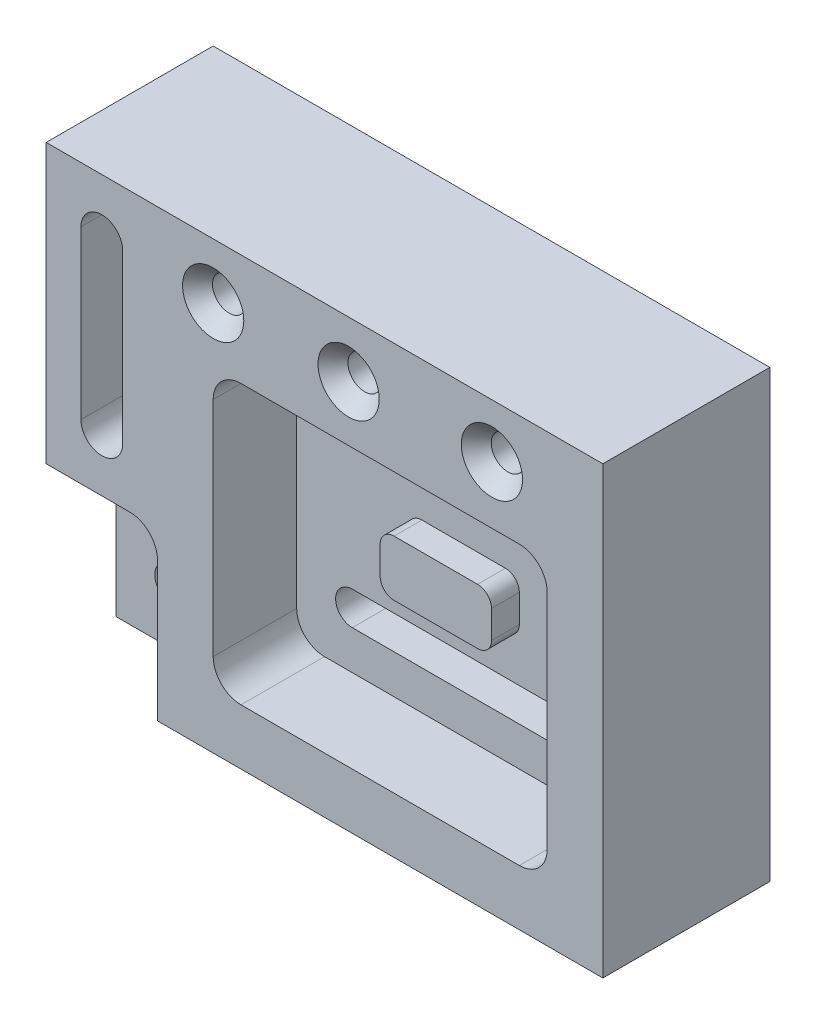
from build123d import *

# Parameters (mm, degrees)
SKETCH1_W           = 200
SKETCH1_H           = 160
BASE_EXTRUDE_DEPTH  = 60
CUT_EXTRUDE1_DEPTH  = 30
CUT_EXTRUDE2_DEPTH  = 25
HOLE1_D             = 12
HOLE1_CSINK_D       = 22
HOLE1_CSINK_ANGLE   = 82
HOLE4_D             = 12
HOLE4_CSINK_D       = 22
HOLE4_CSINK_ANGLE   = 82
HOLE5_D             = 12
HOLE5_CSINK_D       = 22
HOLE5_CSINK_ANGLE   = 82
SKETCH21_R          = 6
CUT_EXTRUDE4_DEPTH  = 133.759180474
CUT_EXTRUDE5_DEPTH  = 25
CUT_EXTRUDE6_DEPTH  = 132.52946438
BOSS_EXTRUDE1_DEPTH = 10


with BuildPart() as part:
    # Sketch1 → Base-Extrude (new body)
    with BuildSketch(Plane.XY):
        Rectangle(SKETCH1_W, SKETCH1_H)
    extrude(amount=-BASE_EXTRUDE_DEPTH)

    # Sketch2 → Cut-Extrude1 (cut)
    with BuildSketch(Plane.XY):
        with BuildLine():
            Line((-30, 40), (70, 40))
            ThreePointArc((70, 40), (77.071067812, 37.071067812), (80, 30))
            Line((80, 30), (80, -50))
            ThreePointArc((80, -50), (77.071067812, -57.071067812), (70, -60))
            Line((70, -60), (-30, -60))
            ThreePointArc((-30, -60), (-37.071067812, -57.071067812), (-40, -50))
            Line((-40, -50), (-40, 30))
            ThreePointArc((-40, 30), (-37.071067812, 37.071067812), (-30, 40))
        make_face()
    extrude(amount=-CUT_EXTRUDE1_DEPTH, mode=Mode.SUBTRACT)

    # Sketch3 → Cut-Extrude2 (cut)
    with BuildSketch(Plane.XY):
        with BuildLine():
            Line((-120, -20), (-70, -20))
            ThreePointArc((-70, -20), (-62.928932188, -22.928932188), (-60, -30))
            Line((-60, -30), (-60, -100))
            Line((-60, -100), (-120, -100))
            Line((-120, -100), (-120, -20))
        make_face()
    extrude(amount=-CUT_EXTRUDE2_DEPTH, mode=Mode.SUBTRACT)

    # Hole1 (through all)
    with Locations(Plane.XY):
        with Locations((-40, 60)):
            CounterSinkHole(HOLE1_D / 2, HOLE1_CSINK_D / 2, counter_sink_angle=HOLE1_CSINK_ANGLE)

    # Hole4 (through all)
    with Locations(Plane(origin=(41.997272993, -0.127725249, 0), x_dir=(1, 0, 0), z_dir=(0, 0, 1))):
        with Locations((-33.333333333, 60)):
            CounterSinkHole(HOLE4_D / 2, HOLE4_CSINK_D / 2, counter_sink_angle=HOLE4_CSINK_ANGLE)

    # Hole5 (through all)
    with Locations(Plane(origin=(100.148393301, 0.657149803, 0), x_dir=(1, 0, 0), z_dir=(0, 0, 1))):
        with Locations((-40, 60)):
            CounterSinkHole(HOLE5_D / 2, HOLE5_CSINK_D / 2, counter_sink_angle=HOLE5_CSINK_ANGLE)

    # Sketch21 → Cut-Extrude4 (cut, through all)
    with BuildSketch(Plane.XY.offset(-25)):
        with Locations((-80, -33.333333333)):
            Circle(SKETCH21_R)
        with Locations((-80, -60)):
            Circle(SKETCH21_R)
    extrude(amount=-CUT_EXTRUDE4_DEPTH, mode=Mode.SUBTRACT)

    # Sketch22 → Cut-Extrude5 (cut)
    with BuildSketch(Plane.XY):
        with BuildLine():
            Line((-72.5, 60), (-72.5, 0))
            ThreePointArc((-72.5, 0), (-80, -7.5), (-87.5, 0))
            Line((-87.5, 0), (-87.5, 60))
            ThreePointArc((-87.5, 60), (-80, 67.5), (-72.5, 60))
        make_face()
    extrude(amount=-CUT_EXTRUDE5_DEPTH, mode=Mode.SUBTRACT)

    # Sketch23 → Cut-Extrude6 (cut, through all)
    with BuildSketch(Plane.XY.offset(-30)):
        with BuildLine():
            Line((-20, 26), (60.148393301, 26))
            ThreePointArc((60.148393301, 26), (66.148393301, 20), (60.148393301, 14))
            Line((60.148393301, 14), (-20, 14))
            ThreePointArc((-20, 14), (-26, 20), (-20, 26))
        make_face()
        with BuildLine():
            Line((-20, -34), (60.148393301, -34))
            ThreePointArc((60.148393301, -34), (66.148393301, -40), (60.148393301, -46))
            Line((60.148393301, -46), (-20, -46))
            ThreePointArc((-20, -46), (-26, -40), (-20, -34))
        make_face()
    extrude(amount=-CUT_EXTRUDE6_DEPTH, mode=Mode.SUBTRACT)

    # Sketch24 → Boss-Extrude1 (add)
    with BuildSketch(Plane.XY.offset(-30)):
        with BuildLine():
            Line((5, 0), (35, 0))
            ThreePointArc((35, 0), (38.535533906, -1.464466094), (40, -5))
            Line((40, -5), (40, -15))
            ThreePointArc((40, -15), (38.535533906, -18.535533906), (35, -20))
            Line((35, -20), (5, -20))
            ThreePointArc((5, -20), (1.464466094, -18.535533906), (0, -15))
            Line((0, -15), (0, -5))
            ThreePointArc((0, -5), (1.464466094, -1.464466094), (5, 0))
        make_face()
    extrude(amount=BOSS_EXTRUDE1_DEPTH)


solid = part.part
